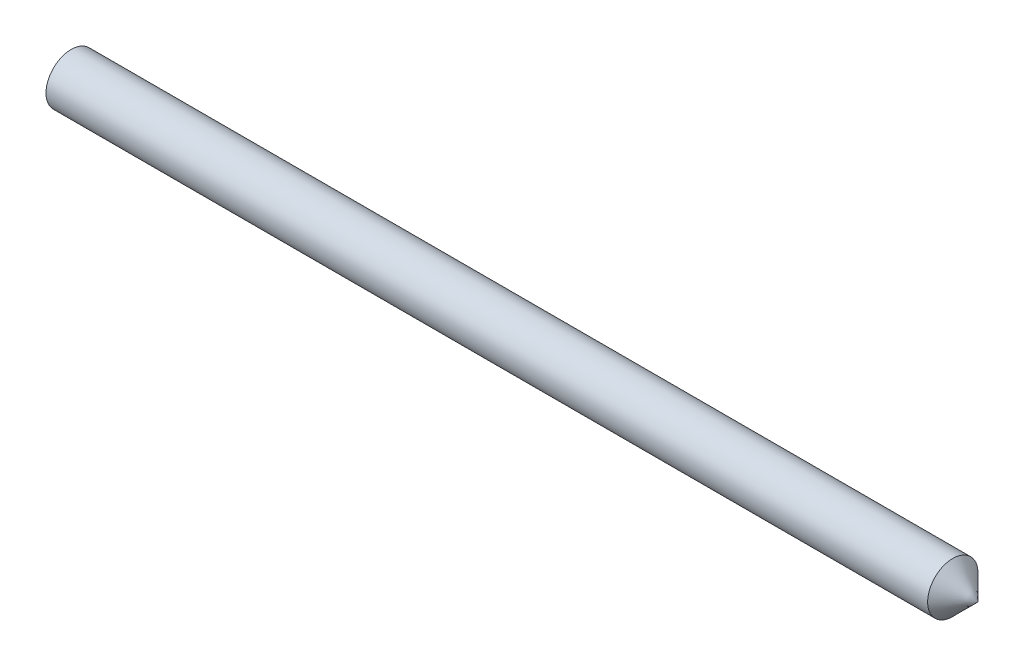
ISO-10303-21;
HEADER;
FILE_DESCRIPTION(('STEP AP214'),'2;1');
FILE_NAME('part.step','',(''),(''),'','','');
FILE_SCHEMA(('AUTOMOTIVE_DESIGN { 1 0 10303 214 1 1 1 1 }'));
ENDSEC;
DATA;
#1=APPLICATION_CONTEXT('core data for automotive mechanical design processes');
#2=APPLICATION_PROTOCOL_DEFINITION('international standard','automotive_design',2000,#1);
#3=PRODUCT_CONTEXT('',#1,'mechanical');
#4=PRODUCT('Part','Part','',(#3));
#5=PRODUCT_RELATED_PRODUCT_CATEGORY('part','',(#4));
#6=PRODUCT_DEFINITION_FORMATION('','',#4);
#7=PRODUCT_DEFINITION_CONTEXT('part definition',#1,'design');
#8=PRODUCT_DEFINITION('design','',#6,#7);
#9=PRODUCT_DEFINITION_SHAPE('','',#8);
#10=(LENGTH_UNIT() NAMED_UNIT(*) SI_UNIT(.MILLI.,.METRE.));
#11=(NAMED_UNIT(*) PLANE_ANGLE_UNIT() SI_UNIT($,.RADIAN.));
#12=(NAMED_UNIT(*) SI_UNIT($,.STERADIAN.) SOLID_ANGLE_UNIT());
#13=UNCERTAINTY_MEASURE_WITH_UNIT(LENGTH_MEASURE(1.E-05),#10,'distance_accuracy_value','');
#14=(GEOMETRIC_REPRESENTATION_CONTEXT(3) GLOBAL_UNCERTAINTY_ASSIGNED_CONTEXT((#13)) GLOBAL_UNIT_ASSIGNED_CONTEXT((#10,
#11,#12)) REPRESENTATION_CONTEXT('',''));
#15=CARTESIAN_POINT('',(0.,0.,0.));
#16=DIRECTION('',(0.,0.,1.));
#17=DIRECTION('',(1.,0.,0.));
#18=AXIS2_PLACEMENT_3D('',#15,#16,#17);
#19=CARTESIAN_POINT('',(0.,0.,0.));
#20=DIRECTION('',(1.,0.,0.));
#21=DIRECTION('',(0.,0.,-1.));
#22=AXIS2_PLACEMENT_3D('',#19,#20,#21);
#23=PLANE('',#22);
#24=CARTESIAN_POINT('',(0.,0.,0.));
#25=DIRECTION('',(-1.,0.,0.));
#26=DIRECTION('',(0.,0.,1.));
#27=AXIS2_PLACEMENT_3D('',#24,#25,#26);
#28=CIRCLE('',#27,2.2225);
#29=CARTESIAN_POINT('',(0.,0.,2.2225));
#30=VERTEX_POINT('',#29);
#31=EDGE_CURVE('E11',#30,#30,#28,.T.);
#32=ORIENTED_EDGE('',*,*,#31,.T.);
#33=EDGE_LOOP('',(#32));
#34=FACE_BOUND('',#33,.T.);
#35=ADVANCED_FACE('F32',(#34),#23,.F.);
#36=CARTESIAN_POINT('',(0.,0.,0.));
#37=DIRECTION('',(-1.,0.,0.));
#38=DIRECTION('',(0.,0.,1.));
#39=AXIS2_PLACEMENT_3D('',#36,#37,#38);
#40=CYLINDRICAL_SURFACE('',#39,2.2225);
#41=ORIENTED_EDGE('',*,*,#31,.F.);
#42=EDGE_LOOP('',(#41));
#43=FACE_BOUND('',#42,.T.);
#44=CARTESIAN_POINT('',(77.7875,0.,0.));
#45=DIRECTION('',(-1.,0.,0.));
#46=DIRECTION('',(0.,0.,1.));
#47=AXIS2_PLACEMENT_3D('',#44,#45,#46);
#48=CIRCLE('',#47,2.2225);
#49=CARTESIAN_POINT('',(77.7875,0.,2.2225));
#50=VERTEX_POINT('',#49);
#51=EDGE_CURVE('E38',#50,#50,#48,.T.);
#52=ORIENTED_EDGE('',*,*,#51,.T.);
#53=EDGE_LOOP('',(#52));
#54=FACE_BOUND('',#53,.T.);
#55=ADVANCED_FACE('F43',(#43,#54),#40,.T.);
#56=CARTESIAN_POINT('',(80.01,0.,0.));
#57=DIRECTION('',(-1.,0.,0.));
#58=DIRECTION('',(0.,0.,1.));
#59=AXIS2_PLACEMENT_3D('',#56,#57,#58);
#60=CONICAL_SURFACE('',#59,0.,0.785398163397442);
#61=ORIENTED_EDGE('',*,*,#51,.F.);
#62=EDGE_LOOP('',(#61));
#63=FACE_BOUND('',#62,.T.);
#64=CARTESIAN_POINT('',(80.01,0.,0.));
#65=VERTEX_POINT('',#64);
#66=VERTEX_LOOP('',#65);
#67=FACE_BOUND('',#66,.T.);
#68=ADVANCED_FACE('F41',(#63,#67),#60,.T.);
#69=CLOSED_SHELL('',(#35,#55,#68));
#70=MANIFOLD_SOLID_BREP('B2',#69);
#71=ADVANCED_BREP_SHAPE_REPRESENTATION('',(#18,#70),#14);
#72=SHAPE_DEFINITION_REPRESENTATION(#9,#71);
ENDSEC;
END-ISO-10303-21;
